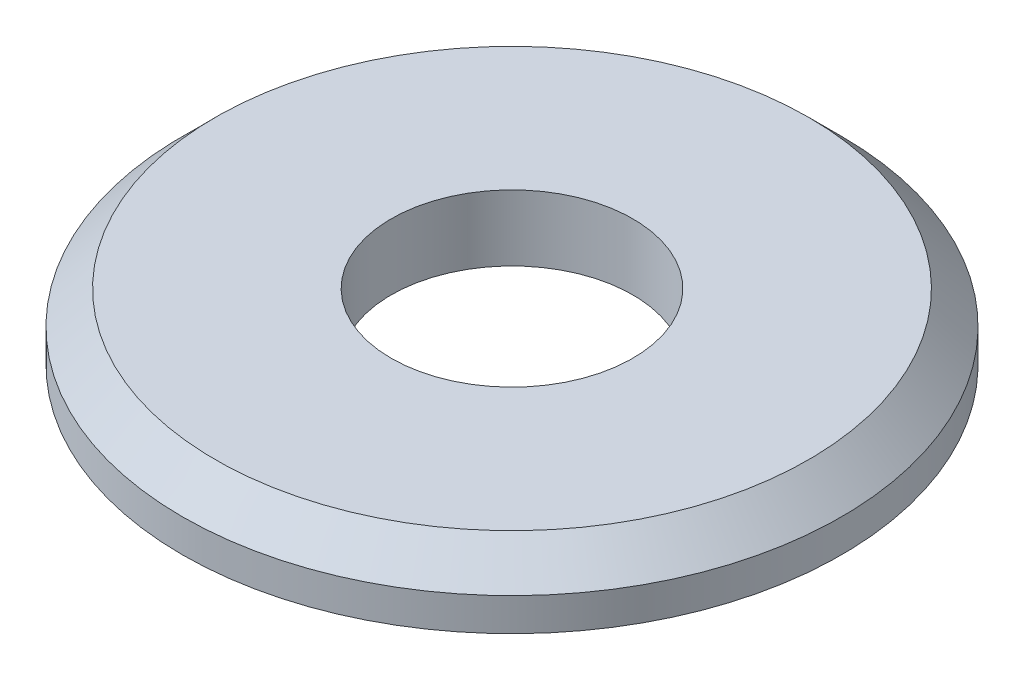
from build123d import *

# Parameters (mm, degrees)
SKETCH1_R      = 1.5
SKETCH1_R_2    = 0.55
EXTRUDE1_DEPTH = 0.3
CHAMFER1_SIZE  = 0.15


with BuildPart() as part:
    # Sketch1 → Extrude1 (new body)
    with BuildSketch(Plane(origin=(0, 0, 0), x_dir=(1, 0, 0), z_dir=(0, 1, 0))):
        with Locations(Location((0, 0, 0), (0, 0, 270))):
            Circle(SKETCH1_R)
        with Locations(Location((0, 0, 0), (0, 0, 270))):
            Circle(SKETCH1_R_2, mode=Mode.SUBTRACT)
    extrude(amount=EXTRUDE1_DEPTH)

    # Chamfer1
    chamfer1_edges = [part.edges().sort_by_distance(p)[0] for p in [
        (0, 0.3, -1.5),
    ]]
    chamfer(chamfer1_edges, length=CHAMFER1_SIZE)


solid = part.part
